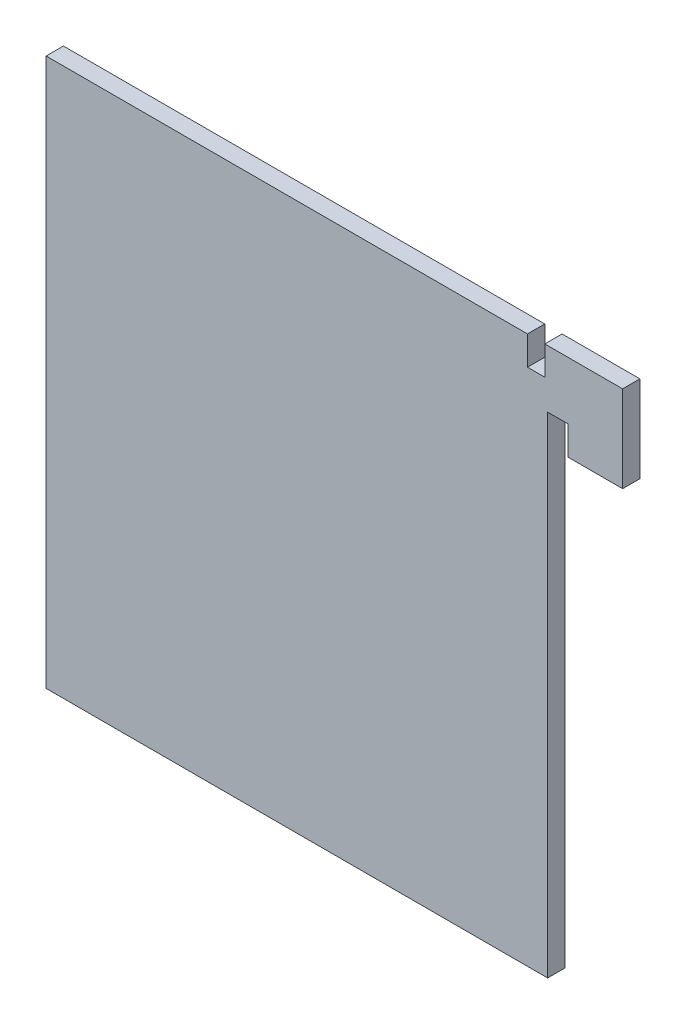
from build123d import *

# Parameters (mm, degrees)
ESQUISSE1_W             = 100
ESQUISSE1_H             = 95
EXTRUSION1_DEPTH        = 3
ESQUISSE2_W             = 3
ESQUISSE2_H             = 5
ESQUISSE2_W_2           = 13
ESQUISSE2_H_2           = 80
ENL_V_MAT_EXTRU_1_DEPTH = 3
ESQUISSE3_W             = 3.5
ESQUISSE3_H             = 5
ENL_V_MAT_EXTRU_2_DEPTH = 3


with BuildPart() as part:
    # Esquisse1 → Extrusion1 (new body)
    with BuildSketch(Plane.XY):
        with Locations((50, 47.5)):
            Rectangle(ESQUISSE1_W, ESQUISSE1_H)
    extrude(amount=EXTRUSION1_DEPTH)

    # Esquisse2 → Enl_v. mat.-Extru.1 (cut)
    with BuildSketch(Plane.XY.offset(3)):
        with Locations((85, 92.5)):
            Rectangle(ESQUISSE2_W, ESQUISSE2_H)
        with Locations((93.5, 40)):
            Rectangle(ESQUISSE2_W_2, ESQUISSE2_H_2)
    extrude(amount=-ENL_V_MAT_EXTRU_1_DEPTH, mode=Mode.SUBTRACT)

    # Esquisse3 → Enl_v. mat.-Extru.2 (cut)
    with BuildSketch(Plane.XY.offset(3)):
        with Locations((88.75, 82.5)):
            Rectangle(ESQUISSE3_W, ESQUISSE3_H)
    extrude(amount=-ENL_V_MAT_EXTRU_2_DEPTH, mode=Mode.SUBTRACT)


solid = part.part
